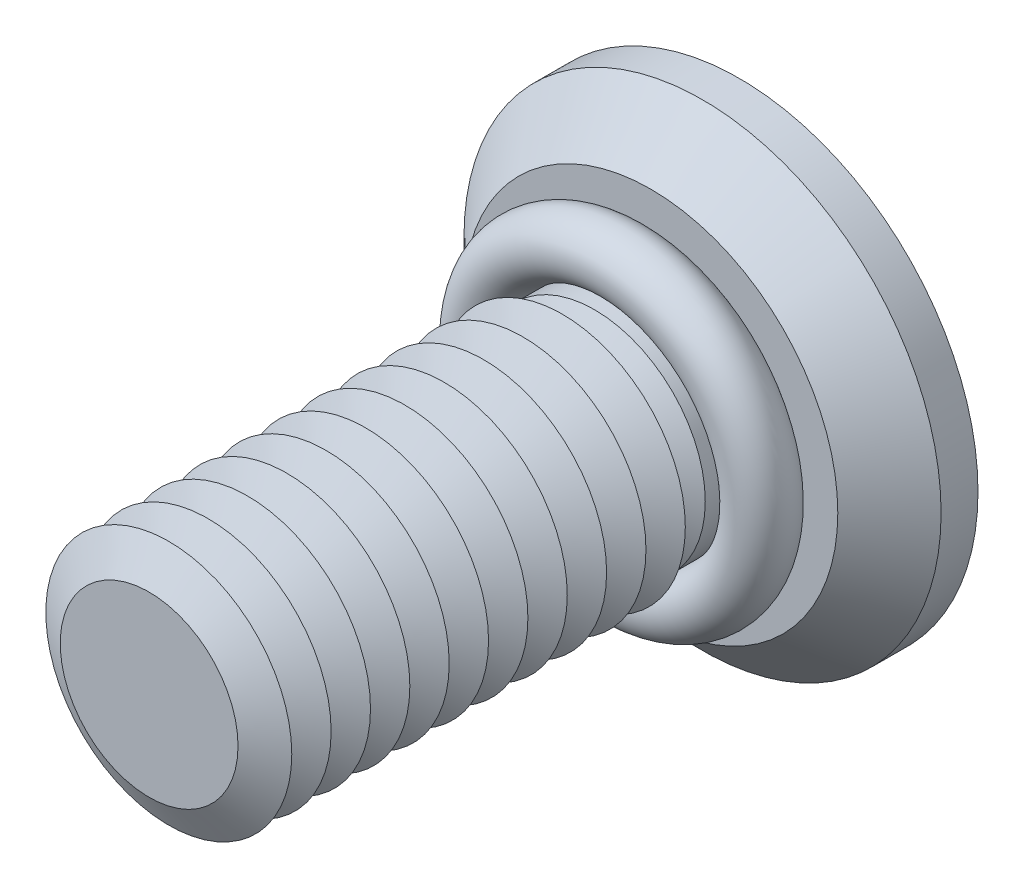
ISO-10303-21;
HEADER;
FILE_DESCRIPTION(('STEP AP214'),'2;1');
FILE_NAME('part.step','',(''),(''),'','','');
FILE_SCHEMA(('AUTOMOTIVE_DESIGN { 1 0 10303 214 1 1 1 1 }'));
ENDSEC;
DATA;
#1=APPLICATION_CONTEXT('core data for automotive mechanical design processes');
#2=APPLICATION_PROTOCOL_DEFINITION('international standard','automotive_design',2000,#1);
#3=PRODUCT_CONTEXT('',#1,'mechanical');
#4=PRODUCT('Part','Part','',(#3));
#5=PRODUCT_RELATED_PRODUCT_CATEGORY('part','',(#4));
#6=PRODUCT_DEFINITION_FORMATION('','',#4);
#7=PRODUCT_DEFINITION_CONTEXT('part definition',#1,'design');
#8=PRODUCT_DEFINITION('design','',#6,#7);
#9=PRODUCT_DEFINITION_SHAPE('','',#8);
#10=(LENGTH_UNIT() NAMED_UNIT(*) SI_UNIT(.MILLI.,.METRE.));
#11=(NAMED_UNIT(*) PLANE_ANGLE_UNIT() SI_UNIT($,.RADIAN.));
#12=(NAMED_UNIT(*) SI_UNIT($,.STERADIAN.) SOLID_ANGLE_UNIT());
#13=UNCERTAINTY_MEASURE_WITH_UNIT(LENGTH_MEASURE(1.E-05),#10,'distance_accuracy_value','');
#14=(GEOMETRIC_REPRESENTATION_CONTEXT(3) GLOBAL_UNCERTAINTY_ASSIGNED_CONTEXT((#13)) GLOBAL_UNIT_ASSIGNED_CONTEXT((#10,
#11,#12)) REPRESENTATION_CONTEXT('',''));
#15=CARTESIAN_POINT('',(0.,0.,0.));
#16=DIRECTION('',(0.,0.,1.));
#17=DIRECTION('',(1.,0.,0.));
#18=AXIS2_PLACEMENT_3D('',#15,#16,#17);
#19=CARTESIAN_POINT('',(0.,0.,2.4));
#20=DIRECTION('',(0.,0.,1.));
#21=DIRECTION('',(1.,0.,0.));
#22=AXIS2_PLACEMENT_3D('',#19,#20,#21);
#23=TOROIDAL_SURFACE('',#22,2.85,0.6);
#24=CARTESIAN_POINT('',(0.,2.85,2.4));
#25=DIRECTION('',(1.,0.,0.));
#26=DIRECTION('',(0.,0.,-1.));
#27=AXIS2_PLACEMENT_3D('',#24,#25,#26);
#28=CIRCLE('',#27,0.6);
#29=CARTESIAN_POINT('',(0.,3.45,2.4));
#30=VERTEX_POINT('',#29);
#31=EDGE_CURVE('P0_E10',#30,#30,#28,.T.);
#32=CARTESIAN_POINT('',(0.,0.,2.4));
#33=DIRECTION('',(0.,0.,1.));
#34=DIRECTION('',(1.,0.,0.));
#35=AXIS2_PLACEMENT_3D('',#32,#33,#34);
#36=CIRCLE('',#35,3.45);
#37=EDGE_CURVE('',#30,#30,#36,.T.);
#38=ORIENTED_EDGE('',*,*,#31,.F.);
#39=ORIENTED_EDGE('',*,*,#31,.T.);
#40=ORIENTED_EDGE('',*,*,#37,.T.);
#41=ORIENTED_EDGE('',*,*,#37,.F.);
#42=EDGE_LOOP('',(#38,#40,#39,#41));
#43=FACE_BOUND('',#42,.T.);
#44=ADVANCED_FACE('P0_F14',(#43),#23,.T.);
#45=CLOSED_SHELL('',(#44));
#46=MANIFOLD_SOLID_BREP('P0_B1',#45);
#47=CARTESIAN_POINT('',(0.,0.,8.));
#48=DIRECTION('',(0.,0.,-1.));
#49=DIRECTION('',(-1.,0.,0.));
#50=AXIS2_PLACEMENT_3D('',#47,#48,#49);
#51=CONICAL_SURFACE('',#50,1.80717967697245,1.0471975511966);
#52=CARTESIAN_POINT('',(0.,0.,7.6));
#53=DIRECTION('',(0.,0.,1.));
#54=DIRECTION('',(1.,0.,0.));
#55=AXIS2_PLACEMENT_3D('',#52,#53,#54);
#56=CIRCLE('',#55,2.5);
#57=CARTESIAN_POINT('',(2.5,0.,7.6));
#58=VERTEX_POINT('',#57);
#59=EDGE_CURVE('P1_E324',#58,#58,#56,.T.);
#60=ORIENTED_EDGE('',*,*,#59,.T.);
#61=EDGE_LOOP('',(#60));
#62=FACE_BOUND('',#61,.T.);
#63=CARTESIAN_POINT('',(0.,0.,8.));
#64=DIRECTION('',(0.,0.,1.));
#65=DIRECTION('',(1.,0.,0.));
#66=AXIS2_PLACEMENT_3D('',#63,#64,#65);
#67=CIRCLE('',#66,1.80717967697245);
#68=CARTESIAN_POINT('',(1.80717967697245,0.,8.));
#69=VERTEX_POINT('',#68);
#70=EDGE_CURVE('P1_E321',#69,#69,#67,.T.);
#71=ORIENTED_EDGE('',*,*,#70,.F.);
#72=EDGE_LOOP('',(#71));
#73=FACE_BOUND('',#72,.T.);
#74=ADVANCED_FACE('P1_F15',(#62,#73),#51,.T.);
#75=CARTESIAN_POINT('',(0.,0.,8.4));
#76=DIRECTION('',(0.,0.,1.));
#77=DIRECTION('',(1.,0.,0.));
#78=AXIS2_PLACEMENT_3D('',#75,#76,#77);
#79=CONICAL_SURFACE('',#78,2.5,1.0471975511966);
#80=ORIENTED_EDGE('',*,*,#70,.T.);
#81=EDGE_LOOP('',(#80));
#82=FACE_BOUND('',#81,.T.);
#83=CARTESIAN_POINT('',(0.,0.,8.4));
#84=DIRECTION('',(0.,0.,1.));
#85=DIRECTION('',(1.,0.,0.));
#86=AXIS2_PLACEMENT_3D('',#83,#84,#85);
#87=CIRCLE('',#86,2.5);
#88=CARTESIAN_POINT('',(2.5,0.,8.4));
#89=VERTEX_POINT('',#88);
#90=EDGE_CURVE('P1_E318',#89,#89,#87,.T.);
#91=ORIENTED_EDGE('',*,*,#90,.F.);
#92=EDGE_LOOP('',(#91));
#93=FACE_BOUND('',#92,.T.);
#94=ADVANCED_FACE('P1_F245',(#82,#93),#79,.T.);
#95=CARTESIAN_POINT('',(0.,0.,12.));
#96=DIRECTION('',(0.,0.,1.));
#97=DIRECTION('',(1.,0.,0.));
#98=AXIS2_PLACEMENT_3D('',#95,#96,#97);
#99=PLANE('',#98);
#100=CARTESIAN_POINT('',(0.,0.,12.));
#101=DIRECTION('',(0.,0.,1.));
#102=DIRECTION('',(1.,0.,0.));
#103=AXIS2_PLACEMENT_3D('',#100,#101,#102);
#104=CIRCLE('',#103,1.80717967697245);
#105=CARTESIAN_POINT('',(1.80717967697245,0.,12.));
#106=VERTEX_POINT('',#105);
#107=EDGE_CURVE('P1_E131',#106,#106,#104,.T.);
#108=ORIENTED_EDGE('',*,*,#107,.T.);
#109=EDGE_LOOP('',(#108));
#110=FACE_BOUND('',#109,.T.);
#111=ADVANCED_FACE('P1_F251',(#110),#99,.T.);
#112=CARTESIAN_POINT('',(0.,0.,12.));
#113=DIRECTION('',(0.,0.,-1.));
#114=DIRECTION('',(-1.,0.,0.));
#115=AXIS2_PLACEMENT_3D('',#112,#113,#114);
#116=CONICAL_SURFACE('',#115,1.80717967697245,1.0471975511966);
#117=CARTESIAN_POINT('',(0.,0.,11.6));
#118=DIRECTION('',(0.,0.,1.));
#119=DIRECTION('',(1.,0.,0.));
#120=AXIS2_PLACEMENT_3D('',#117,#118,#119);
#121=CIRCLE('',#120,2.5);
#122=CARTESIAN_POINT('',(2.5,0.,11.6));
#123=VERTEX_POINT('',#122);
#124=EDGE_CURVE('P1_E133',#123,#123,#121,.T.);
#125=ORIENTED_EDGE('',*,*,#124,.T.);
#126=EDGE_LOOP('',(#125));
#127=FACE_BOUND('',#126,.T.);
#128=ORIENTED_EDGE('',*,*,#107,.F.);
#129=EDGE_LOOP('',(#128));
#130=FACE_BOUND('',#129,.T.);
#131=ADVANCED_FACE('P1_F196',(#127,#130),#116,.T.);
#132=CARTESIAN_POINT('',(0.,0.,11.6));
#133=DIRECTION('',(0.,0.,1.));
#134=DIRECTION('',(1.,0.,0.));
#135=AXIS2_PLACEMENT_3D('',#132,#133,#134);
#136=CONICAL_SURFACE('',#135,2.5,1.0471975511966);
#137=CARTESIAN_POINT('',(0.,0.,11.2));
#138=DIRECTION('',(0.,0.,1.));
#139=DIRECTION('',(1.,0.,0.));
#140=AXIS2_PLACEMENT_3D('',#137,#138,#139);
#141=CIRCLE('',#140,1.80717967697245);
#142=CARTESIAN_POINT('',(1.80717967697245,0.,11.2));
#143=VERTEX_POINT('',#142);
#144=EDGE_CURVE('P1_E297',#143,#143,#141,.T.);
#145=ORIENTED_EDGE('',*,*,#144,.T.);
#146=EDGE_LOOP('',(#145));
#147=FACE_BOUND('',#146,.T.);
#148=ORIENTED_EDGE('',*,*,#124,.F.);
#149=EDGE_LOOP('',(#148));
#150=FACE_BOUND('',#149,.T.);
#151=ADVANCED_FACE('P1_F284',(#147,#150),#136,.T.);
#152=CARTESIAN_POINT('',(0.,0.,11.2));
#153=DIRECTION('',(0.,0.,-1.));
#154=DIRECTION('',(-1.,0.,0.));
#155=AXIS2_PLACEMENT_3D('',#152,#153,#154);
#156=CONICAL_SURFACE('',#155,1.80717967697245,1.0471975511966);
#157=CARTESIAN_POINT('',(0.,0.,10.8));
#158=DIRECTION('',(0.,0.,1.));
#159=DIRECTION('',(1.,0.,0.));
#160=AXIS2_PLACEMENT_3D('',#157,#158,#159);
#161=CIRCLE('',#160,2.5);
#162=CARTESIAN_POINT('',(2.5,0.,10.8));
#163=VERTEX_POINT('',#162);
#164=EDGE_CURVE('P1_E294',#163,#163,#161,.T.);
#165=ORIENTED_EDGE('',*,*,#164,.T.);
#166=EDGE_LOOP('',(#165));
#167=FACE_BOUND('',#166,.T.);
#168=ORIENTED_EDGE('',*,*,#144,.F.);
#169=EDGE_LOOP('',(#168));
#170=FACE_BOUND('',#169,.T.);
#171=ADVANCED_FACE('P1_F279',(#167,#170),#156,.T.);
#172=CARTESIAN_POINT('',(0.,0.,10.8));
#173=DIRECTION('',(0.,0.,1.));
#174=DIRECTION('',(1.,0.,0.));
#175=AXIS2_PLACEMENT_3D('',#172,#173,#174);
#176=CONICAL_SURFACE('',#175,2.5,1.0471975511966);
#177=CARTESIAN_POINT('',(0.,0.,10.4));
#178=DIRECTION('',(0.,0.,1.));
#179=DIRECTION('',(1.,0.,0.));
#180=AXIS2_PLACEMENT_3D('',#177,#178,#179);
#181=CIRCLE('',#180,1.80717967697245);
#182=CARTESIAN_POINT('',(1.80717967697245,0.,10.4));
#183=VERTEX_POINT('',#182);
#184=EDGE_CURVE('P1_E301',#183,#183,#181,.T.);
#185=ORIENTED_EDGE('',*,*,#184,.T.);
#186=EDGE_LOOP('',(#185));
#187=FACE_BOUND('',#186,.T.);
#188=ORIENTED_EDGE('',*,*,#164,.F.);
#189=EDGE_LOOP('',(#188));
#190=FACE_BOUND('',#189,.T.);
#191=ADVANCED_FACE('P1_F276',(#187,#190),#176,.T.);
#192=CARTESIAN_POINT('',(0.,0.,10.4));
#193=DIRECTION('',(0.,0.,-1.));
#194=DIRECTION('',(-1.,0.,0.));
#195=AXIS2_PLACEMENT_3D('',#192,#193,#194);
#196=CONICAL_SURFACE('',#195,1.80717967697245,1.0471975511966);
#197=CARTESIAN_POINT('',(0.,0.,10.));
#198=DIRECTION('',(0.,0.,1.));
#199=DIRECTION('',(1.,0.,0.));
#200=AXIS2_PLACEMENT_3D('',#197,#198,#199);
#201=CIRCLE('',#200,2.5);
#202=CARTESIAN_POINT('',(2.5,0.,10.));
#203=VERTEX_POINT('',#202);
#204=EDGE_CURVE('P1_E306',#203,#203,#201,.T.);
#205=ORIENTED_EDGE('',*,*,#204,.T.);
#206=EDGE_LOOP('',(#205));
#207=FACE_BOUND('',#206,.T.);
#208=ORIENTED_EDGE('',*,*,#184,.F.);
#209=EDGE_LOOP('',(#208));
#210=FACE_BOUND('',#209,.T.);
#211=ADVANCED_FACE('P1_F271',(#207,#210),#196,.T.);
#212=CARTESIAN_POINT('',(0.,0.,10.));
#213=DIRECTION('',(0.,0.,1.));
#214=DIRECTION('',(1.,0.,0.));
#215=AXIS2_PLACEMENT_3D('',#212,#213,#214);
#216=CONICAL_SURFACE('',#215,2.5,1.0471975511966);
#217=CARTESIAN_POINT('',(0.,0.,9.6));
#218=DIRECTION('',(0.,0.,1.));
#219=DIRECTION('',(1.,0.,0.));
#220=AXIS2_PLACEMENT_3D('',#217,#218,#219);
#221=CIRCLE('',#220,1.80717967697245);
#222=CARTESIAN_POINT('',(1.80717967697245,0.,9.6));
#223=VERTEX_POINT('',#222);
#224=EDGE_CURVE('P1_E309',#223,#223,#221,.T.);
#225=ORIENTED_EDGE('',*,*,#224,.T.);
#226=EDGE_LOOP('',(#225));
#227=FACE_BOUND('',#226,.T.);
#228=ORIENTED_EDGE('',*,*,#204,.F.);
#229=EDGE_LOOP('',(#228));
#230=FACE_BOUND('',#229,.T.);
#231=ADVANCED_FACE('P1_F268',(#227,#230),#216,.T.);
#232=CARTESIAN_POINT('',(0.,0.,9.6));
#233=DIRECTION('',(0.,0.,-1.));
#234=DIRECTION('',(-1.,0.,0.));
#235=AXIS2_PLACEMENT_3D('',#232,#233,#234);
#236=CONICAL_SURFACE('',#235,1.80717967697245,1.0471975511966);
#237=CARTESIAN_POINT('',(0.,0.,9.2));
#238=DIRECTION('',(0.,0.,1.));
#239=DIRECTION('',(1.,0.,0.));
#240=AXIS2_PLACEMENT_3D('',#237,#238,#239);
#241=CIRCLE('',#240,2.5);
#242=CARTESIAN_POINT('',(2.5,0.,9.2));
#243=VERTEX_POINT('',#242);
#244=EDGE_CURVE('P1_E312',#243,#243,#241,.T.);
#245=ORIENTED_EDGE('',*,*,#244,.T.);
#246=EDGE_LOOP('',(#245));
#247=FACE_BOUND('',#246,.T.);
#248=ORIENTED_EDGE('',*,*,#224,.F.);
#249=EDGE_LOOP('',(#248));
#250=FACE_BOUND('',#249,.T.);
#251=ADVANCED_FACE('P1_F262',(#247,#250),#236,.T.);
#252=CARTESIAN_POINT('',(0.,0.,9.2));
#253=DIRECTION('',(0.,0.,1.));
#254=DIRECTION('',(1.,0.,0.));
#255=AXIS2_PLACEMENT_3D('',#252,#253,#254);
#256=CONICAL_SURFACE('',#255,2.5,1.0471975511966);
#257=CARTESIAN_POINT('',(0.,0.,8.8));
#258=DIRECTION('',(0.,0.,1.));
#259=DIRECTION('',(1.,0.,0.));
#260=AXIS2_PLACEMENT_3D('',#257,#258,#259);
#261=CIRCLE('',#260,1.80717967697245);
#262=CARTESIAN_POINT('',(1.80717967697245,0.,8.8));
#263=VERTEX_POINT('',#262);
#264=EDGE_CURVE('P1_E315',#263,#263,#261,.T.);
#265=ORIENTED_EDGE('',*,*,#264,.T.);
#266=EDGE_LOOP('',(#265));
#267=FACE_BOUND('',#266,.T.);
#268=ORIENTED_EDGE('',*,*,#244,.F.);
#269=EDGE_LOOP('',(#268));
#270=FACE_BOUND('',#269,.T.);
#271=ADVANCED_FACE('P1_F258',(#267,#270),#256,.T.);
#272=CARTESIAN_POINT('',(0.,0.,8.8));
#273=DIRECTION('',(0.,0.,-1.));
#274=DIRECTION('',(-1.,0.,0.));
#275=AXIS2_PLACEMENT_3D('',#272,#273,#274);
#276=CONICAL_SURFACE('',#275,1.80717967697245,1.0471975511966);
#277=ORIENTED_EDGE('',*,*,#90,.T.);
#278=EDGE_LOOP('',(#277));
#279=FACE_BOUND('',#278,.T.);
#280=ORIENTED_EDGE('',*,*,#264,.F.);
#281=EDGE_LOOP('',(#280));
#282=FACE_BOUND('',#281,.T.);
#283=ADVANCED_FACE('P1_F261',(#279,#282),#276,.T.);
#284=CARTESIAN_POINT('',(0.,0.,7.2));
#285=DIRECTION('',(0.,0.,-1.));
#286=DIRECTION('',(-1.,0.,0.));
#287=AXIS2_PLACEMENT_3D('',#284,#285,#286);
#288=CONICAL_SURFACE('',#287,1.80717967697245,1.0471975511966);
#289=CARTESIAN_POINT('',(0.,0.,6.8));
#290=DIRECTION('',(0.,0.,1.));
#291=DIRECTION('',(1.,0.,0.));
#292=AXIS2_PLACEMENT_3D('',#289,#290,#291);
#293=CIRCLE('',#292,2.5);
#294=CARTESIAN_POINT('',(2.5,0.,6.8));
#295=VERTEX_POINT('',#294);
#296=EDGE_CURVE('P1_E329',#295,#295,#293,.T.);
#297=ORIENTED_EDGE('',*,*,#296,.T.);
#298=EDGE_LOOP('',(#297));
#299=FACE_BOUND('',#298,.T.);
#300=CARTESIAN_POINT('',(0.,0.,7.2));
#301=DIRECTION('',(0.,0.,1.));
#302=DIRECTION('',(1.,0.,0.));
#303=AXIS2_PLACEMENT_3D('',#300,#301,#302);
#304=CIRCLE('',#303,1.80717967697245);
#305=CARTESIAN_POINT('',(1.80717967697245,0.,7.2));
#306=VERTEX_POINT('',#305);
#307=EDGE_CURVE('P1_E326',#306,#306,#304,.T.);
#308=ORIENTED_EDGE('',*,*,#307,.F.);
#309=EDGE_LOOP('',(#308));
#310=FACE_BOUND('',#309,.T.);
#311=ADVANCED_FACE('P1_F266',(#299,#310),#288,.T.);
#312=CARTESIAN_POINT('',(0.,0.,7.6));
#313=DIRECTION('',(0.,0.,1.));
#314=DIRECTION('',(1.,0.,0.));
#315=AXIS2_PLACEMENT_3D('',#312,#313,#314);
#316=CONICAL_SURFACE('',#315,2.5,1.0471975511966);
#317=ORIENTED_EDGE('',*,*,#307,.T.);
#318=EDGE_LOOP('',(#317));
#319=FACE_BOUND('',#318,.T.);
#320=ORIENTED_EDGE('',*,*,#59,.F.);
#321=EDGE_LOOP('',(#320));
#322=FACE_BOUND('',#321,.T.);
#323=ADVANCED_FACE('P1_F461',(#319,#322),#316,.T.);
#324=CARTESIAN_POINT('',(0.,0.,6.4));
#325=DIRECTION('',(0.,0.,-1.));
#326=DIRECTION('',(-1.,0.,0.));
#327=AXIS2_PLACEMENT_3D('',#324,#325,#326);
#328=CONICAL_SURFACE('',#327,1.80717967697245,1.0471975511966);
#329=CARTESIAN_POINT('',(0.,0.,6.));
#330=DIRECTION('',(0.,0.,1.));
#331=DIRECTION('',(1.,0.,0.));
#332=AXIS2_PLACEMENT_3D('',#329,#330,#331);
#333=CIRCLE('',#332,2.5);
#334=CARTESIAN_POINT('',(2.5,0.,6.));
#335=VERTEX_POINT('',#334);
#336=EDGE_CURVE('P1_E335',#335,#335,#333,.T.);
#337=ORIENTED_EDGE('',*,*,#336,.T.);
#338=EDGE_LOOP('',(#337));
#339=FACE_BOUND('',#338,.T.);
#340=CARTESIAN_POINT('',(0.,0.,6.4));
#341=DIRECTION('',(0.,0.,1.));
#342=DIRECTION('',(1.,0.,0.));
#343=AXIS2_PLACEMENT_3D('',#340,#341,#342);
#344=CIRCLE('',#343,1.80717967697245);
#345=CARTESIAN_POINT('',(1.80717967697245,0.,6.4));
#346=VERTEX_POINT('',#345);
#347=EDGE_CURVE('P1_E332',#346,#346,#344,.T.);
#348=ORIENTED_EDGE('',*,*,#347,.F.);
#349=EDGE_LOOP('',(#348));
#350=FACE_BOUND('',#349,.T.);
#351=ADVANCED_FACE('P1_F470',(#339,#350),#328,.T.);
#352=CARTESIAN_POINT('',(0.,0.,6.8));
#353=DIRECTION('',(0.,0.,1.));
#354=DIRECTION('',(1.,0.,0.));
#355=AXIS2_PLACEMENT_3D('',#352,#353,#354);
#356=CONICAL_SURFACE('',#355,2.5,1.0471975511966);
#357=ORIENTED_EDGE('',*,*,#347,.T.);
#358=EDGE_LOOP('',(#357));
#359=FACE_BOUND('',#358,.T.);
#360=ORIENTED_EDGE('',*,*,#296,.F.);
#361=EDGE_LOOP('',(#360));
#362=FACE_BOUND('',#361,.T.);
#363=ADVANCED_FACE('P1_F480',(#359,#362),#356,.T.);
#364=CARTESIAN_POINT('',(0.,0.,5.6));
#365=DIRECTION('',(0.,0.,-1.));
#366=DIRECTION('',(-1.,0.,0.));
#367=AXIS2_PLACEMENT_3D('',#364,#365,#366);
#368=CONICAL_SURFACE('',#367,1.80717967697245,1.0471975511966);
#369=CARTESIAN_POINT('',(0.,0.,5.2));
#370=DIRECTION('',(0.,0.,1.));
#371=DIRECTION('',(1.,0.,0.));
#372=AXIS2_PLACEMENT_3D('',#369,#370,#371);
#373=CIRCLE('',#372,2.5);
#374=CARTESIAN_POINT('',(2.5,0.,5.2));
#375=VERTEX_POINT('',#374);
#376=EDGE_CURVE('P1_E341',#375,#375,#373,.T.);
#377=ORIENTED_EDGE('',*,*,#376,.T.);
#378=EDGE_LOOP('',(#377));
#379=FACE_BOUND('',#378,.T.);
#380=CARTESIAN_POINT('',(0.,0.,5.6));
#381=DIRECTION('',(0.,0.,1.));
#382=DIRECTION('',(1.,0.,0.));
#383=AXIS2_PLACEMENT_3D('',#380,#381,#382);
#384=CIRCLE('',#383,1.80717967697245);
#385=CARTESIAN_POINT('',(1.80717967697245,0.,5.6));
#386=VERTEX_POINT('',#385);
#387=EDGE_CURVE('P1_E338',#386,#386,#384,.T.);
#388=ORIENTED_EDGE('',*,*,#387,.F.);
#389=EDGE_LOOP('',(#388));
#390=FACE_BOUND('',#389,.T.);
#391=ADVANCED_FACE('P1_F490',(#379,#390),#368,.T.);
#392=CARTESIAN_POINT('',(0.,0.,6.));
#393=DIRECTION('',(0.,0.,1.));
#394=DIRECTION('',(1.,0.,0.));
#395=AXIS2_PLACEMENT_3D('',#392,#393,#394);
#396=CONICAL_SURFACE('',#395,2.5,1.0471975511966);
#397=ORIENTED_EDGE('',*,*,#387,.T.);
#398=EDGE_LOOP('',(#397));
#399=FACE_BOUND('',#398,.T.);
#400=ORIENTED_EDGE('',*,*,#336,.F.);
#401=EDGE_LOOP('',(#400));
#402=FACE_BOUND('',#401,.T.);
#403=ADVANCED_FACE('P1_F500',(#399,#402),#396,.T.);
#404=CARTESIAN_POINT('',(0.,0.,4.8));
#405=DIRECTION('',(0.,0.,-1.));
#406=DIRECTION('',(-1.,0.,0.));
#407=AXIS2_PLACEMENT_3D('',#404,#405,#406);
#408=CONICAL_SURFACE('',#407,1.80717967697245,1.0471975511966);
#409=CARTESIAN_POINT('',(0.,0.,4.4));
#410=DIRECTION('',(0.,0.,1.));
#411=DIRECTION('',(1.,0.,0.));
#412=AXIS2_PLACEMENT_3D('',#409,#410,#411);
#413=CIRCLE('',#412,2.5);
#414=CARTESIAN_POINT('',(2.5,0.,4.4));
#415=VERTEX_POINT('',#414);
#416=EDGE_CURVE('P1_E347',#415,#415,#413,.T.);
#417=ORIENTED_EDGE('',*,*,#416,.T.);
#418=EDGE_LOOP('',(#417));
#419=FACE_BOUND('',#418,.T.);
#420=CARTESIAN_POINT('',(0.,0.,4.8));
#421=DIRECTION('',(0.,0.,1.));
#422=DIRECTION('',(1.,0.,0.));
#423=AXIS2_PLACEMENT_3D('',#420,#421,#422);
#424=CIRCLE('',#423,1.80717967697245);
#425=CARTESIAN_POINT('',(1.80717967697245,0.,4.8));
#426=VERTEX_POINT('',#425);
#427=EDGE_CURVE('P1_E344',#426,#426,#424,.T.);
#428=ORIENTED_EDGE('',*,*,#427,.F.);
#429=EDGE_LOOP('',(#428));
#430=FACE_BOUND('',#429,.T.);
#431=ADVANCED_FACE('P1_F510',(#419,#430),#408,.T.);
#432=CARTESIAN_POINT('',(0.,0.,5.2));
#433=DIRECTION('',(0.,0.,1.));
#434=DIRECTION('',(1.,0.,0.));
#435=AXIS2_PLACEMENT_3D('',#432,#433,#434);
#436=CONICAL_SURFACE('',#435,2.5,1.0471975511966);
#437=ORIENTED_EDGE('',*,*,#427,.T.);
#438=EDGE_LOOP('',(#437));
#439=FACE_BOUND('',#438,.T.);
#440=ORIENTED_EDGE('',*,*,#376,.F.);
#441=EDGE_LOOP('',(#440));
#442=FACE_BOUND('',#441,.T.);
#443=ADVANCED_FACE('P1_F520',(#439,#442),#436,.T.);
#444=CARTESIAN_POINT('',(0.,0.,4.));
#445=DIRECTION('',(0.,0.,-1.));
#446=DIRECTION('',(-1.,0.,0.));
#447=AXIS2_PLACEMENT_3D('',#444,#445,#446);
#448=CONICAL_SURFACE('',#447,1.80717967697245,1.0471975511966);
#449=CARTESIAN_POINT('',(0.,0.,3.6));
#450=DIRECTION('',(0.,0.,1.));
#451=DIRECTION('',(1.,0.,0.));
#452=AXIS2_PLACEMENT_3D('',#449,#450,#451);
#453=CIRCLE('',#452,2.5);
#454=CARTESIAN_POINT('',(2.5,0.,3.6));
#455=VERTEX_POINT('',#454);
#456=EDGE_CURVE('P1_E353',#455,#455,#453,.T.);
#457=ORIENTED_EDGE('',*,*,#456,.T.);
#458=EDGE_LOOP('',(#457));
#459=FACE_BOUND('',#458,.T.);
#460=CARTESIAN_POINT('',(0.,0.,4.));
#461=DIRECTION('',(0.,0.,1.));
#462=DIRECTION('',(1.,0.,0.));
#463=AXIS2_PLACEMENT_3D('',#460,#461,#462);
#464=CIRCLE('',#463,1.80717967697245);
#465=CARTESIAN_POINT('',(1.80717967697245,0.,4.));
#466=VERTEX_POINT('',#465);
#467=EDGE_CURVE('P1_E350',#466,#466,#464,.T.);
#468=ORIENTED_EDGE('',*,*,#467,.F.);
#469=EDGE_LOOP('',(#468));
#470=FACE_BOUND('',#469,.T.);
#471=ADVANCED_FACE('P1_F530',(#459,#470),#448,.T.);
#472=CARTESIAN_POINT('',(0.,0.,4.4));
#473=DIRECTION('',(0.,0.,1.));
#474=DIRECTION('',(1.,0.,0.));
#475=AXIS2_PLACEMENT_3D('',#472,#473,#474);
#476=CONICAL_SURFACE('',#475,2.5,1.0471975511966);
#477=ORIENTED_EDGE('',*,*,#467,.T.);
#478=EDGE_LOOP('',(#477));
#479=FACE_BOUND('',#478,.T.);
#480=ORIENTED_EDGE('',*,*,#416,.F.);
#481=EDGE_LOOP('',(#480));
#482=FACE_BOUND('',#481,.T.);
#483=ADVANCED_FACE('P1_F366',(#479,#482),#476,.T.);
#484=CARTESIAN_POINT('',(0.,0.,3.2));
#485=DIRECTION('',(0.,0.,-1.));
#486=DIRECTION('',(-1.,0.,0.));
#487=AXIS2_PLACEMENT_3D('',#484,#485,#486);
#488=CONICAL_SURFACE('',#487,1.80717967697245,1.0471975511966);
#489=CARTESIAN_POINT('',(0.,0.,3.2));
#490=DIRECTION('',(0.,0.,1.));
#491=DIRECTION('',(1.,0.,0.));
#492=AXIS2_PLACEMENT_3D('',#489,#490,#491);
#493=CIRCLE('',#492,1.80717967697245);
#494=CARTESIAN_POINT('',(1.80717967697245,0.,3.2));
#495=VERTEX_POINT('',#494);
#496=EDGE_CURVE('P1_E356',#495,#495,#493,.T.);
#497=ORIENTED_EDGE('',*,*,#496,.F.);
#498=EDGE_LOOP('',(#497));
#499=FACE_BOUND('',#498,.T.);
#500=CARTESIAN_POINT('',(0.,0.,2.9443375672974));
#501=DIRECTION('',(0.,0.,-1.));
#502=DIRECTION('',(-1.,0.,0.));
#503=AXIS2_PLACEMENT_3D('',#500,#501,#502);
#504=CIRCLE('',#503,2.25);
#505=CARTESIAN_POINT('',(-2.25,0.,2.9443375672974));
#506=VERTEX_POINT('',#505);
#507=EDGE_CURVE('P1_E19',#506,#506,#504,.F.);
#508=ORIENTED_EDGE('',*,*,#507,.T.);
#509=EDGE_LOOP('',(#508));
#510=FACE_BOUND('',#509,.T.);
#511=ADVANCED_FACE('P1_F363',(#499,#510),#488,.T.);
#512=CARTESIAN_POINT('',(0.,0.,3.6));
#513=DIRECTION('',(0.,0.,1.));
#514=DIRECTION('',(1.,0.,0.));
#515=AXIS2_PLACEMENT_3D('',#512,#513,#514);
#516=CONICAL_SURFACE('',#515,2.5,1.0471975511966);
#517=ORIENTED_EDGE('',*,*,#496,.T.);
#518=EDGE_LOOP('',(#517));
#519=FACE_BOUND('',#518,.T.);
#520=ORIENTED_EDGE('',*,*,#456,.F.);
#521=EDGE_LOOP('',(#520));
#522=FACE_BOUND('',#521,.T.);
#523=ADVANCED_FACE('P1_F360',(#519,#522),#516,.T.);
#524=CARTESIAN_POINT('',(0.,0.,2.));
#525=DIRECTION('',(0.,0.,-1.));
#526=DIRECTION('',(-1.,0.,0.));
#527=AXIS2_PLACEMENT_3D('',#524,#525,#526);
#528=CONICAL_SURFACE('',#527,1.5,1.0471975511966);
#529=CARTESIAN_POINT('',(0.,0.,2.86602540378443));
#530=VERTEX_POINT('',#529);
#531=VERTEX_LOOP('',#530);
#532=FACE_BOUND('',#531,.T.);
#533=CARTESIAN_POINT('',(0.,0.,2.));
#534=DIRECTION('',(0.,0.,-1.));
#535=DIRECTION('',(-1.,0.,0.));
#536=AXIS2_PLACEMENT_3D('',#533,#534,#535);
#537=CIRCLE('',#536,1.5);
#538=CARTESIAN_POINT('',(-1.5,0.,2.));
#539=VERTEX_POINT('',#538);
#540=CARTESIAN_POINT('',(-0.75,1.29903810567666,2.));
#541=VERTEX_POINT('',#540);
#542=EDGE_CURVE('P1_E117',#539,#541,#537,.T.);
#543=ORIENTED_EDGE('',*,*,#542,.T.);
#544=CARTESIAN_POINT('',(0.,0.,2.));
#545=DIRECTION('',(0.,0.,-1.));
#546=DIRECTION('',(-1.,0.,0.));
#547=AXIS2_PLACEMENT_3D('',#544,#545,#546);
#548=CIRCLE('',#547,1.5);
#549=CARTESIAN_POINT('',(0.75,1.29903810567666,2.));
#550=VERTEX_POINT('',#549);
#551=EDGE_CURVE('P1_E24',#541,#550,#548,.T.);
#552=ORIENTED_EDGE('',*,*,#551,.T.);
#553=CARTESIAN_POINT('',(1.5,0.,2.));
#554=VERTEX_POINT('',#553);
#555=EDGE_CURVE('P1_E765',#550,#554,#548,.T.);
#556=ORIENTED_EDGE('',*,*,#555,.T.);
#557=CARTESIAN_POINT('',(0.750000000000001,-1.29903810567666,2.));
#558=VERTEX_POINT('',#557);
#559=EDGE_CURVE('P1_E758',#554,#558,#548,.T.);
#560=ORIENTED_EDGE('',*,*,#559,.T.);
#561=CARTESIAN_POINT('',(-0.75,-1.29903810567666,2.));
#562=VERTEX_POINT('',#561);
#563=EDGE_CURVE('P1_E182',#558,#562,#548,.T.);
#564=ORIENTED_EDGE('',*,*,#563,.T.);
#565=EDGE_CURVE('P1_E179',#562,#539,#548,.T.);
#566=ORIENTED_EDGE('',*,*,#565,.T.);
#567=EDGE_LOOP('',(#543,#552,#556,#560,#564,#566));
#568=FACE_BOUND('',#567,.T.);
#569=ADVANCED_FACE('P1_F198',(#532,#568),#528,.F.);
#570=CARTESIAN_POINT('',(0.,0.,2.));
#571=DIRECTION('',(0.,0.,-1.));
#572=DIRECTION('',(-1.,0.,0.));
#573=AXIS2_PLACEMENT_3D('',#570,#571,#572);
#574=PLANE('',#573);
#575=ORIENTED_EDGE('',*,*,#563,.F.);
#576=DIRECTION('',(-0.866025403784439,-0.5,0.));
#577=VECTOR('',#576,1.);
#578=CARTESIAN_POINT('',(1.5,-0.866025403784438,2.));
#579=LINE('',#578,#577);
#580=CARTESIAN_POINT('',(0.,-1.73205080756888,2.));
#581=VERTEX_POINT('',#580);
#582=EDGE_CURVE('P1_E774',#558,#581,#579,.T.);
#583=ORIENTED_EDGE('',*,*,#582,.T.);
#584=DIRECTION('',(-0.866025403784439,0.5,0.));
#585=VECTOR('',#584,1.);
#586=CARTESIAN_POINT('',(0.,-1.73205080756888,2.));
#587=LINE('',#586,#585);
#588=EDGE_CURVE('P1_E781',#581,#562,#587,.T.);
#589=ORIENTED_EDGE('',*,*,#588,.T.);
#590=EDGE_LOOP('',(#575,#583,#589));
#591=FACE_BOUND('',#590,.T.);
#592=ADVANCED_FACE('P1_F572',(#591),#574,.T.);
#593=ORIENTED_EDGE('',*,*,#565,.F.);
#594=CARTESIAN_POINT('',(-1.5,-0.86602540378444,2.));
#595=VERTEX_POINT('',#594);
#596=EDGE_CURVE('P1_E784',#562,#595,#587,.T.);
#597=ORIENTED_EDGE('',*,*,#596,.T.);
#598=DIRECTION('',(0.,1.,0.));
#599=VECTOR('',#598,1.);
#600=CARTESIAN_POINT('',(-1.5,-0.86602540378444,2.));
#601=LINE('',#600,#599);
#602=EDGE_CURVE('P1_E123',#595,#539,#601,.T.);
#603=ORIENTED_EDGE('',*,*,#602,.T.);
#604=EDGE_LOOP('',(#593,#597,#603));
#605=FACE_BOUND('',#604,.T.);
#606=ADVANCED_FACE('P1_F231',(#605),#574,.T.);
#607=ORIENTED_EDGE('',*,*,#542,.F.);
#608=CARTESIAN_POINT('',(-1.5,0.866025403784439,2.));
#609=VERTEX_POINT('',#608);
#610=EDGE_CURVE('P1_E786',#539,#609,#601,.T.);
#611=ORIENTED_EDGE('',*,*,#610,.T.);
#612=DIRECTION('',(0.866025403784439,0.5,0.));
#613=VECTOR('',#612,1.);
#614=CARTESIAN_POINT('',(-1.5,0.866025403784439,2.));
#615=LINE('',#614,#613);
#616=EDGE_CURVE('P1_E789',#609,#541,#615,.T.);
#617=ORIENTED_EDGE('',*,*,#616,.T.);
#618=EDGE_LOOP('',(#607,#611,#617));
#619=FACE_BOUND('',#618,.T.);
#620=ADVANCED_FACE('P1_F589',(#619),#574,.T.);
#621=ORIENTED_EDGE('',*,*,#551,.F.);
#622=CARTESIAN_POINT('',(0.,1.73205080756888,2.));
#623=VERTEX_POINT('',#622);
#624=EDGE_CURVE('P1_E788',#541,#623,#615,.T.);
#625=ORIENTED_EDGE('',*,*,#624,.T.);
#626=DIRECTION('',(0.866025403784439,-0.5,0.));
#627=VECTOR('',#626,1.);
#628=CARTESIAN_POINT('',(0.,1.73205080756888,2.));
#629=LINE('',#628,#627);
#630=EDGE_CURVE('P1_E161',#623,#550,#629,.T.);
#631=ORIENTED_EDGE('',*,*,#630,.T.);
#632=EDGE_LOOP('',(#621,#625,#631));
#633=FACE_BOUND('',#632,.T.);
#634=ADVANCED_FACE('P1_F598',(#633),#574,.T.);
#635=ORIENTED_EDGE('',*,*,#555,.F.);
#636=CARTESIAN_POINT('',(1.5,0.866025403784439,2.));
#637=VERTEX_POINT('',#636);
#638=EDGE_CURVE('P1_E773',#550,#637,#629,.T.);
#639=ORIENTED_EDGE('',*,*,#638,.T.);
#640=DIRECTION('',(0.,-1.,0.));
#641=VECTOR('',#640,1.);
#642=CARTESIAN_POINT('',(1.5,0.866025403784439,2.));
#643=LINE('',#642,#641);
#644=EDGE_CURVE('P1_E768',#637,#554,#643,.T.);
#645=ORIENTED_EDGE('',*,*,#644,.T.);
#646=EDGE_LOOP('',(#635,#639,#645));
#647=FACE_BOUND('',#646,.T.);
#648=ADVANCED_FACE('P1_F607',(#647),#574,.T.);
#649=ORIENTED_EDGE('',*,*,#559,.F.);
#650=CARTESIAN_POINT('',(1.5,-0.866025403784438,2.));
#651=VERTEX_POINT('',#650);
#652=EDGE_CURVE('P1_E760',#554,#651,#643,.T.);
#653=ORIENTED_EDGE('',*,*,#652,.T.);
#654=EDGE_CURVE('P1_E125',#651,#558,#579,.T.);
#655=ORIENTED_EDGE('',*,*,#654,.T.);
#656=EDGE_LOOP('',(#649,#653,#655));
#657=FACE_BOUND('',#656,.T.);
#658=ADVANCED_FACE('P1_F229',(#657),#574,.T.);
#659=CARTESIAN_POINT('',(1.5,-0.866025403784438,2.));
#660=DIRECTION('',(0.5,-0.866025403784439,0.));
#661=DIRECTION('',(0.866025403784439,0.5,0.));
#662=AXIS2_PLACEMENT_3D('',#659,#660,#661);
#663=PLANE('',#662);
#664=DIRECTION('',(0.,0.,-1.));
#665=VECTOR('',#664,1.);
#666=CARTESIAN_POINT('',(1.5,-0.866025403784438,2.));
#667=LINE('',#666,#665);
#668=CARTESIAN_POINT('',(1.5,-0.866025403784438,0.));
#669=VERTEX_POINT('',#668);
#670=EDGE_CURVE('P1_E164',#651,#669,#667,.T.);
#671=ORIENTED_EDGE('',*,*,#670,.T.);
#672=CARTESIAN_POINT('',(1.5002,-0.865909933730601,-3.09432014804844E-05));
#673=CARTESIAN_POINT('',(1.43789222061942,-0.901883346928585,0.00961367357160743));
#674=CARTESIAN_POINT('',(1.37547144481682,-0.937921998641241,0.0183695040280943));
#675=CARTESIAN_POINT('',(1.25040937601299,-1.01012661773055,0.0337528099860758));
#676=CARTESIAN_POINT('',(1.18776800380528,-1.04629263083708,0.0403794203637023));
#677=CARTESIAN_POINT('',(1.06264466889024,-1.11853262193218,0.0511173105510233));
#678=CARTESIAN_POINT('',(1.00016355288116,-1.15460611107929,0.0552413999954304));
#679=CARTESIAN_POINT('',(0.875121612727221,-1.22679910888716,0.0607713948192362));
#680=CARTESIAN_POINT('',(0.812560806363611,-1.26291860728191,0.0621778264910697));
#681=CARTESIAN_POINT('',(0.68743919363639,-1.33515760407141,0.0621778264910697));
#682=CARTESIAN_POINT('',(0.62487838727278,-1.37127710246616,0.0607713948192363));
#683=CARTESIAN_POINT('',(0.49983644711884,-1.44347010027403,0.0552413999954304));
#684=CARTESIAN_POINT('',(0.437355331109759,-1.47954358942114,0.0511173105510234));
#685=CARTESIAN_POINT('',(0.312231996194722,-1.55178358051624,0.0403794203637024));
#686=CARTESIAN_POINT('',(0.249590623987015,-1.58794959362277,0.0337528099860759));
#687=CARTESIAN_POINT('',(0.124528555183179,-1.66015421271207,0.0183695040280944));
#688=CARTESIAN_POINT('',(0.0621077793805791,-1.69619286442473,0.00961367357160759));
#689=CARTESIAN_POINT('',(-0.000199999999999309,-1.73216627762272,-3.09432014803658E-05));
#690=B_SPLINE_CURVE_WITH_KNOTS('',3,(#672,#673,#674,#675,#676,#677,#678,#679,#680,#681,#682,
#683,#684,#685,#686,#687,#688,#689),.UNSPECIFIED.,.F.,.F.,(4,2,2,2,2,2,2,2,4),(0.,
0.217782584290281,0.435653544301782,0.652399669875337,0.869103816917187,1.08580796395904,
1.30255408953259,1.52042504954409,1.73820763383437),.UNSPECIFIED.);
#691=CARTESIAN_POINT('',(0.,-1.73205080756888,0.));
#692=VERTEX_POINT('',#691);
#693=EDGE_CURVE('P1_E118',#669,#692,#690,.T.);
#694=ORIENTED_EDGE('',*,*,#693,.T.);
#695=DIRECTION('',(0.,0.,-1.));
#696=VECTOR('',#695,1.);
#697=CARTESIAN_POINT('',(0.,-1.73205080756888,2.));
#698=LINE('',#697,#696);
#699=EDGE_CURVE('P1_E116',#581,#692,#698,.T.);
#700=ORIENTED_EDGE('',*,*,#699,.F.);
#701=ORIENTED_EDGE('',*,*,#582,.F.);
#702=ORIENTED_EDGE('',*,*,#654,.F.);
#703=EDGE_LOOP('',(#671,#694,#700,#701,#702));
#704=FACE_BOUND('',#703,.T.);
#705=ADVANCED_FACE('P1_F226',(#704),#663,.F.);
#706=CARTESIAN_POINT('',(0.,-1.73205080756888,2.));
#707=DIRECTION('',(-0.5,-0.866025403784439,0.));
#708=DIRECTION('',(0.866025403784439,-0.5,0.));
#709=AXIS2_PLACEMENT_3D('',#706,#707,#708);
#710=PLANE('',#709);
#711=ORIENTED_EDGE('',*,*,#699,.T.);
#712=CARTESIAN_POINT('',(0.000200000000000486,-1.73216627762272,-3.09432014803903E-05));
#713=CARTESIAN_POINT('',(-0.0621077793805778,-1.69619286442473,0.00961367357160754));
#714=CARTESIAN_POINT('',(-0.124528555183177,-1.66015421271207,0.0183695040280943));
#715=CARTESIAN_POINT('',(-0.249590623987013,-1.58794959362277,0.0337528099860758));
#716=CARTESIAN_POINT('',(-0.312231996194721,-1.55178358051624,0.0403794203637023));
#717=CARTESIAN_POINT('',(-0.437355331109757,-1.47954358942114,0.0511173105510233));
#718=CARTESIAN_POINT('',(-0.499836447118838,-1.44347010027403,0.0552413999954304));
#719=CARTESIAN_POINT('',(-0.624878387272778,-1.37127710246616,0.0607713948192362));
#720=CARTESIAN_POINT('',(-0.687439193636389,-1.33515760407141,0.0621778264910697));
#721=CARTESIAN_POINT('',(-0.81256080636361,-1.26291860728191,0.0621778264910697));
#722=CARTESIAN_POINT('',(-0.87512161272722,-1.22679910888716,0.0607713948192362));
#723=CARTESIAN_POINT('',(-1.00016355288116,-1.15460611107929,0.0552413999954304));
#724=CARTESIAN_POINT('',(-1.06264466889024,-1.11853262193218,0.0511173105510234));
#725=CARTESIAN_POINT('',(-1.18776800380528,-1.04629263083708,0.0403794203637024));
#726=CARTESIAN_POINT('',(-1.25040937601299,-1.01012661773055,0.0337528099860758));
#727=CARTESIAN_POINT('',(-1.37547144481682,-0.937921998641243,0.0183695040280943));
#728=CARTESIAN_POINT('',(-1.43789222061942,-0.901883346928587,0.00961367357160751));
#729=CARTESIAN_POINT('',(-1.5002,-0.865909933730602,-3.09432014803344E-05));
#730=B_SPLINE_CURVE_WITH_KNOTS('',3,(#712,#713,#714,#715,#716,#717,#718,#719,#720,#721,#722,
#723,#724,#725,#726,#727,#728,#729),.UNSPECIFIED.,.F.,.F.,(4,2,2,2,2,2,2,2,4),(0.,
0.217782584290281,0.435653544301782,0.652399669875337,0.869103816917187,1.08580796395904,
1.30255408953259,1.52042504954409,1.73820763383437),.UNSPECIFIED.);
#731=CARTESIAN_POINT('',(-1.5,-0.86602540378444,0.));
#732=VERTEX_POINT('',#731);
#733=EDGE_CURVE('P1_E94',#692,#732,#730,.T.);
#734=ORIENTED_EDGE('',*,*,#733,.T.);
#735=DIRECTION('',(0.,0.,-1.));
#736=VECTOR('',#735,1.);
#737=CARTESIAN_POINT('',(-1.5,-0.86602540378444,2.));
#738=LINE('',#737,#736);
#739=EDGE_CURVE('P1_E112',#595,#732,#738,.T.);
#740=ORIENTED_EDGE('',*,*,#739,.F.);
#741=ORIENTED_EDGE('',*,*,#596,.F.);
#742=ORIENTED_EDGE('',*,*,#588,.F.);
#743=EDGE_LOOP('',(#711,#734,#740,#741,#742));
#744=FACE_BOUND('',#743,.T.);
#745=ADVANCED_FACE('P1_F110',(#744),#710,.F.);
#746=CARTESIAN_POINT('',(-1.5,-0.86602540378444,2.));
#747=DIRECTION('',(-1.,0.,0.));
#748=DIRECTION('',(0.,-1.,0.));
#749=AXIS2_PLACEMENT_3D('',#746,#747,#748);
#750=PLANE('',#749);
#751=ORIENTED_EDGE('',*,*,#739,.T.);
#752=CARTESIAN_POINT('',(-1.5,-2.26080568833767,-0.262887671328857));
#753=CARTESIAN_POINT('',(-1.5,-2.19307335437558,-0.247767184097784));
#754=CARTESIAN_POINT('',(-1.5,-2.12529797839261,-0.232839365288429));
#755=CARTESIAN_POINT('',(-1.5,-1.989639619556,-0.203466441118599));
#756=CARTESIAN_POINT('',(-1.5,-1.92175663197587,-0.189021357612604));
#757=CARTESIAN_POINT('',(-1.5,-1.71778516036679,-0.146529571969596));
#758=CARTESIAN_POINT('',(-1.5,-1.58151166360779,-0.119357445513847));
#759=CARTESIAN_POINT('',(-1.5,-1.30947840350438,-0.0687885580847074));
#760=CARTESIAN_POINT('',(-1.5,-1.17372447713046,-0.0453610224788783));
#761=CARTESIAN_POINT('',(-1.5,-0.901404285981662,-0.0038503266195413));
#762=CARTESIAN_POINT('',(-1.5,-0.764838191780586,0.0142339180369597));
#763=CARTESIAN_POINT('',(-1.5,-0.489293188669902,0.0427079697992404));
#764=CARTESIAN_POINT('',(-1.5,-0.350304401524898,0.0530091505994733));
#765=CARTESIAN_POINT('',(-1.5,-0.141571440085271,0.0608183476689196));
#766=CARTESIAN_POINT('',(-1.5,-0.0719628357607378,0.0621480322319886));
#767=CARTESIAN_POINT('',(-1.5,0.0672555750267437,0.0622066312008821));
#768=CARTESIAN_POINT('',(-1.5,0.136865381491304,0.0609355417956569));
#769=CARTESIAN_POINT('',(-1.5,0.346114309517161,0.0532774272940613));
#770=CARTESIAN_POINT('',(-1.5,0.485619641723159,0.0430252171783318));
#771=CARTESIAN_POINT('',(-1.5,0.763829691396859,0.0143998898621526));
#772=CARTESIAN_POINT('',(-1.5,0.902533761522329,-0.0039790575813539));
#773=CARTESIAN_POINT('',(-1.5,1.18270277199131,-0.046775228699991));
#774=CARTESIAN_POINT('',(-1.5,1.32414472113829,-0.0713381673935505));
#775=CARTESIAN_POINT('',(-1.5,1.60634089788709,-0.124177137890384));
#776=CARTESIAN_POINT('',(-1.5,1.74709501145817,-0.152453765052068));
#777=CARTESIAN_POINT('',(-1.5,2.0281352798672,-0.21141289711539));
#778=CARTESIAN_POINT('',(-1.5,2.16842128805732,-0.242096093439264));
#779=CARTESIAN_POINT('',(-1.5,2.44863558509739,-0.305057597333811));
#780=CARTESIAN_POINT('',(-1.5,2.5885638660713,-0.337335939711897));
#781=CARTESIAN_POINT('',(-1.5,2.86645602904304,-0.402586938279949));
#782=CARTESIAN_POINT('',(-1.5,3.0044230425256,-0.435546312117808));
#783=CARTESIAN_POINT('',(-1.5,3.28017563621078,-0.502227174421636));
#784=CARTESIAN_POINT('',(-1.5,3.41796121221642,-0.535948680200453));
#785=CARTESIAN_POINT('',(-1.5,3.69320305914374,-0.603899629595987));
#786=CARTESIAN_POINT('',(-1.5,3.83065952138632,-0.638128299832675));
#787=CARTESIAN_POINT('',(-1.5,4.10546119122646,-0.707008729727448));
#788=CARTESIAN_POINT('',(-1.5,4.24280640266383,-0.741660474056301));
#789=CARTESIAN_POINT('',(-1.5,4.38011382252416,-0.776459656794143));
#790=B_SPLINE_CURVE_WITH_KNOTS('',3,(#752,#753,#754,#755,#756,#757,#758,#759,#760,#761,#762,
#763,#764,#765,#766,#767,#768,#769,#770,#771,#772,#773,#774,#775,#776,#777,#778,#779,#780,#781,
#782,#783,#784,#785,#786,#787,#788,#789),.UNSPECIFIED.,.F.,.F.,(4,2,2,2,2,2,2,2,2,2,2,2,2,2,2,2,
2,2,4),(0.,0.208198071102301,0.416405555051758,0.833243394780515,1.2464565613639,
1.65958581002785,2.07735129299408,2.28617008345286,2.49498917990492,2.91428402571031,
3.33388016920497,3.76448033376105,4.19514961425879,4.62594308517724,5.05674596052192,
5.48229088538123,5.90784548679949,6.33280701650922,6.75775319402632),.UNSPECIFIED.);
#791=CARTESIAN_POINT('',(-1.5,0.866025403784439,0.));
#792=VERTEX_POINT('',#791);
#793=EDGE_CURVE('P1_E10',#732,#792,#790,.T.);
#794=ORIENTED_EDGE('',*,*,#793,.T.);
#795=DIRECTION('',(0.,0.,-1.));
#796=VECTOR('',#795,1.);
#797=CARTESIAN_POINT('',(-1.5,0.866025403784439,2.));
#798=LINE('',#797,#796);
#799=EDGE_CURVE('P1_E124',#609,#792,#798,.T.);
#800=ORIENTED_EDGE('',*,*,#799,.F.);
#801=ORIENTED_EDGE('',*,*,#610,.F.);
#802=ORIENTED_EDGE('',*,*,#602,.F.);
#803=EDGE_LOOP('',(#751,#794,#800,#801,#802));
#804=FACE_BOUND('',#803,.T.);
#805=ADVANCED_FACE('P1_F120',(#804),#750,.F.);
#806=CARTESIAN_POINT('',(-1.5,0.866025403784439,2.));
#807=DIRECTION('',(-0.5,0.866025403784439,0.));
#808=DIRECTION('',(-0.866025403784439,-0.5,0.));
#809=AXIS2_PLACEMENT_3D('',#806,#807,#808);
#810=PLANE('',#809);
#811=ORIENTED_EDGE('',*,*,#799,.T.);
#812=CARTESIAN_POINT('',(-1.5002,0.865909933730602,-3.09432014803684E-05));
#813=CARTESIAN_POINT('',(-1.43789222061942,0.901883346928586,0.00961367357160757));
#814=CARTESIAN_POINT('',(-1.37547144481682,0.937921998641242,0.0183695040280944));
#815=CARTESIAN_POINT('',(-1.25040937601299,1.01012661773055,0.0337528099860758));
#816=CARTESIAN_POINT('',(-1.18776800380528,1.04629263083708,0.0403794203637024));
#817=CARTESIAN_POINT('',(-1.06264466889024,1.11853262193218,0.0511173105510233));
#818=CARTESIAN_POINT('',(-1.00016355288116,1.15460611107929,0.0552413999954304));
#819=CARTESIAN_POINT('',(-0.875121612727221,1.22679910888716,0.0607713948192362));
#820=CARTESIAN_POINT('',(-0.81256080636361,1.26291860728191,0.0621778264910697));
#821=CARTESIAN_POINT('',(-0.687439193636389,1.33515760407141,0.0621778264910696));
#822=CARTESIAN_POINT('',(-0.624878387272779,1.37127710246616,0.0607713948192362));
#823=CARTESIAN_POINT('',(-0.499836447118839,1.44347010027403,0.0552413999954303));
#824=CARTESIAN_POINT('',(-0.437355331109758,1.47954358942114,0.0511173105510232));
#825=CARTESIAN_POINT('',(-0.312231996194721,1.55178358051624,0.0403794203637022));
#826=CARTESIAN_POINT('',(-0.249590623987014,1.58794959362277,0.0337528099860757));
#827=CARTESIAN_POINT('',(-0.124528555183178,1.66015421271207,0.0183695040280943));
#828=CARTESIAN_POINT('',(-0.0621077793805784,1.69619286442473,0.00961367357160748));
#829=CARTESIAN_POINT('',(0.000199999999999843,1.73216627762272,-3.09432014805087E-05));
#830=B_SPLINE_CURVE_WITH_KNOTS('',3,(#812,#813,#814,#815,#816,#817,#818,#819,#820,#821,#822,
#823,#824,#825,#826,#827,#828,#829),.UNSPECIFIED.,.F.,.F.,(4,2,2,2,2,2,2,2,4),(0.,
0.217782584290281,0.435653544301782,0.652399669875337,0.869103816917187,1.08580796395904,
1.30255408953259,1.52042504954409,1.73820763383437),.UNSPECIFIED.);
#831=CARTESIAN_POINT('',(0.,1.73205080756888,0.));
#832=VERTEX_POINT('',#831);
#833=EDGE_CURVE('P1_E136',#792,#832,#830,.T.);
#834=ORIENTED_EDGE('',*,*,#833,.T.);
#835=DIRECTION('',(0.,0.,-1.));
#836=VECTOR('',#835,1.);
#837=CARTESIAN_POINT('',(0.,1.73205080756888,2.));
#838=LINE('',#837,#836);
#839=EDGE_CURVE('P1_E155',#623,#832,#838,.T.);
#840=ORIENTED_EDGE('',*,*,#839,.F.);
#841=ORIENTED_EDGE('',*,*,#624,.F.);
#842=ORIENTED_EDGE('',*,*,#616,.F.);
#843=EDGE_LOOP('',(#811,#834,#840,#841,#842));
#844=FACE_BOUND('',#843,.T.);
#845=ADVANCED_FACE('P1_F153',(#844),#810,.F.);
#846=CARTESIAN_POINT('',(0.,1.73205080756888,2.));
#847=DIRECTION('',(0.5,0.866025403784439,0.));
#848=DIRECTION('',(-0.866025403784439,0.5,0.));
#849=AXIS2_PLACEMENT_3D('',#846,#847,#848);
#850=PLANE('',#849);
#851=ORIENTED_EDGE('',*,*,#839,.T.);
#852=CARTESIAN_POINT('',(-0.00019999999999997,1.73216627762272,-3.09432014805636E-05));
#853=CARTESIAN_POINT('',(0.0621077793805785,1.69619286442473,0.00961367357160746));
#854=CARTESIAN_POINT('',(0.124528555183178,1.66015421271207,0.0183695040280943));
#855=CARTESIAN_POINT('',(0.249590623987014,1.58794959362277,0.0337528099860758));
#856=CARTESIAN_POINT('',(0.312231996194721,1.55178358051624,0.0403794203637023));
#857=CARTESIAN_POINT('',(0.437355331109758,1.47954358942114,0.0511173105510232));
#858=CARTESIAN_POINT('',(0.499836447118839,1.44347010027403,0.0552413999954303));
#859=CARTESIAN_POINT('',(0.624878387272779,1.37127710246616,0.0607713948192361));
#860=CARTESIAN_POINT('',(0.68743919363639,1.33515760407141,0.0621778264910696));
#861=CARTESIAN_POINT('',(0.812560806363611,1.26291860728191,0.0621778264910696));
#862=CARTESIAN_POINT('',(0.875121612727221,1.22679910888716,0.0607713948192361));
#863=CARTESIAN_POINT('',(1.00016355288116,1.15460611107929,0.0552413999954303));
#864=CARTESIAN_POINT('',(1.06264466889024,1.11853262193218,0.0511173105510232));
#865=CARTESIAN_POINT('',(1.18776800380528,1.04629263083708,0.0403794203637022));
#866=CARTESIAN_POINT('',(1.25040937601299,1.01012661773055,0.0337528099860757));
#867=CARTESIAN_POINT('',(1.37547144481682,0.937921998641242,0.0183695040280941));
#868=CARTESIAN_POINT('',(1.43789222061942,0.901883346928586,0.0096136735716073));
#869=CARTESIAN_POINT('',(1.5002,0.865909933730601,-3.09432014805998E-05));
#870=B_SPLINE_CURVE_WITH_KNOTS('',3,(#852,#853,#854,#855,#856,#857,#858,#859,#860,#861,#862,
#863,#864,#865,#866,#867,#868,#869),.UNSPECIFIED.,.F.,.F.,(4,2,2,2,2,2,2,2,4),(0.,
0.217782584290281,0.435653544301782,0.652399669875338,0.869103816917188,1.08580796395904,
1.30255408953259,1.52042504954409,1.73820763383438),.UNSPECIFIED.);
#871=CARTESIAN_POINT('',(1.5,0.866025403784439,0.));
#872=VERTEX_POINT('',#871);
#873=EDGE_CURVE('P1_E141',#832,#872,#870,.T.);
#874=ORIENTED_EDGE('',*,*,#873,.T.);
#875=DIRECTION('',(0.,0.,-1.));
#876=VECTOR('',#875,1.);
#877=CARTESIAN_POINT('',(1.5,0.866025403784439,2.));
#878=LINE('',#877,#876);
#879=EDGE_CURVE('P1_E162',#637,#872,#878,.T.);
#880=ORIENTED_EDGE('',*,*,#879,.F.);
#881=ORIENTED_EDGE('',*,*,#638,.F.);
#882=ORIENTED_EDGE('',*,*,#630,.F.);
#883=EDGE_LOOP('',(#851,#874,#880,#881,#882));
#884=FACE_BOUND('',#883,.T.);
#885=ADVANCED_FACE('P1_F158',(#884),#850,.F.);
#886=CARTESIAN_POINT('',(1.5,0.866025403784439,2.));
#887=DIRECTION('',(1.,0.,0.));
#888=DIRECTION('',(0.,0.,-1.));
#889=AXIS2_PLACEMENT_3D('',#886,#887,#888);
#890=PLANE('',#889);
#891=ORIENTED_EDGE('',*,*,#879,.T.);
#892=CARTESIAN_POINT('',(1.5,-2.26080568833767,-0.262887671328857));
#893=CARTESIAN_POINT('',(1.5,-2.19307335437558,-0.247767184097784));
#894=CARTESIAN_POINT('',(1.5,-2.12529797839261,-0.232839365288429));
#895=CARTESIAN_POINT('',(1.5,-1.989639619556,-0.203466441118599));
#896=CARTESIAN_POINT('',(1.5,-1.92175663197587,-0.189021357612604));
#897=CARTESIAN_POINT('',(1.5,-1.71778516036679,-0.146529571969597));
#898=CARTESIAN_POINT('',(1.5,-1.58151166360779,-0.119357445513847));
#899=CARTESIAN_POINT('',(1.5,-1.30947840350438,-0.0687885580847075));
#900=CARTESIAN_POINT('',(1.5,-1.17372447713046,-0.0453610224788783));
#901=CARTESIAN_POINT('',(1.5,-0.90140428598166,-0.0038503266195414));
#902=CARTESIAN_POINT('',(1.5,-0.764838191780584,0.0142339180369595));
#903=CARTESIAN_POINT('',(1.5,-0.489293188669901,0.0427079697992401));
#904=CARTESIAN_POINT('',(1.5,-0.350304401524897,0.053009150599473));
#905=CARTESIAN_POINT('',(1.5,-0.14157144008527,0.0608183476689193));
#906=CARTESIAN_POINT('',(1.5,-0.0719628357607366,0.0621480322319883));
#907=CARTESIAN_POINT('',(1.5,0.067255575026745,0.0622066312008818));
#908=CARTESIAN_POINT('',(1.5,0.136865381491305,0.0609355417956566));
#909=CARTESIAN_POINT('',(1.5,0.346114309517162,0.0532774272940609));
#910=CARTESIAN_POINT('',(1.5,0.48561964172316,0.0430252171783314));
#911=CARTESIAN_POINT('',(1.5,0.76382969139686,0.0143998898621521));
#912=CARTESIAN_POINT('',(1.5,0.902533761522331,-0.00397905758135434));
#913=CARTESIAN_POINT('',(1.5,1.18270277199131,-0.0467752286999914));
#914=CARTESIAN_POINT('',(1.5,1.32414472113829,-0.0713381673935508));
#915=CARTESIAN_POINT('',(1.5,1.60634089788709,-0.124177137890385));
#916=CARTESIAN_POINT('',(1.5,1.74709501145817,-0.152453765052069));
#917=CARTESIAN_POINT('',(1.5,2.02813527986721,-0.21141289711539));
#918=CARTESIAN_POINT('',(1.5,2.16842128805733,-0.242096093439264));
#919=CARTESIAN_POINT('',(1.5,2.44863558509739,-0.305057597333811));
#920=CARTESIAN_POINT('',(1.5,2.5885638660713,-0.337335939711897));
#921=CARTESIAN_POINT('',(1.5,2.86645602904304,-0.40258693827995));
#922=CARTESIAN_POINT('',(1.5,3.0044230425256,-0.435546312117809));
#923=CARTESIAN_POINT('',(1.5,3.28017563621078,-0.502227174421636));
#924=CARTESIAN_POINT('',(1.5,3.41796121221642,-0.535948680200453));
#925=CARTESIAN_POINT('',(1.5,3.69320305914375,-0.603899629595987));
#926=CARTESIAN_POINT('',(1.5,3.83065952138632,-0.638128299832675));
#927=CARTESIAN_POINT('',(1.5,4.10546119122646,-0.707008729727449));
#928=CARTESIAN_POINT('',(1.5,4.24280640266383,-0.741660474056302));
#929=CARTESIAN_POINT('',(1.5,4.38011382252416,-0.776459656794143));
#930=B_SPLINE_CURVE_WITH_KNOTS('',3,(#892,#893,#894,#895,#896,#897,#898,#899,#900,#901,#902,
#903,#904,#905,#906,#907,#908,#909,#910,#911,#912,#913,#914,#915,#916,#917,#918,#919,#920,#921,
#922,#923,#924,#925,#926,#927,#928,#929),.UNSPECIFIED.,.F.,.F.,(4,2,2,2,2,2,2,2,2,2,2,2,2,2,2,2,
2,2,4),(0.,0.208198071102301,0.416405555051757,0.833243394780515,1.2464565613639,
1.65958581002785,2.07735129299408,2.28617008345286,2.49498917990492,2.91428402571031,
3.33388016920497,3.76448033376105,4.19514961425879,4.62594308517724,5.05674596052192,
5.48229088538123,5.90784548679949,6.33280701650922,6.75775319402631),.UNSPECIFIED.);
#931=EDGE_CURVE('P1_E149',#872,#669,#930,.F.);
#932=ORIENTED_EDGE('',*,*,#931,.T.);
#933=ORIENTED_EDGE('',*,*,#670,.F.);
#934=ORIENTED_EDGE('',*,*,#652,.F.);
#935=ORIENTED_EDGE('',*,*,#644,.F.);
#936=EDGE_LOOP('',(#891,#932,#933,#934,#935));
#937=FACE_BOUND('',#936,.T.);
#938=ADVANCED_FACE('P1_F232',(#937),#890,.F.);
#939=CARTESIAN_POINT('',(0.,0.,0.));
#940=DIRECTION('',(0.,0.,-1.));
#941=DIRECTION('',(-1.,0.,0.));
#942=AXIS2_PLACEMENT_3D('',#939,#940,#941);
#943=CONICAL_SURFACE('',#942,1.73205080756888,1.30899693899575);
#944=CARTESIAN_POINT('',(0.,0.,0.));
#945=DIRECTION('',(0.,0.,-1.));
#946=DIRECTION('',(-1.,0.,0.));
#947=AXIS2_PLACEMENT_3D('',#944,#945,#946);
#948=CIRCLE('',#947,1.73205080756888);
#949=EDGE_CURVE('P1_E30',#669,#692,#948,.T.);
#950=ORIENTED_EDGE('',*,*,#949,.T.);
#951=ORIENTED_EDGE('',*,*,#693,.F.);
#952=EDGE_LOOP('',(#950,#951));
#953=FACE_BOUND('',#952,.T.);
#954=ADVANCED_FACE('P1_F195',(#953),#943,.F.);
#955=EDGE_CURVE('P1_E90',#692,#732,#948,.T.);
#956=ORIENTED_EDGE('',*,*,#955,.T.);
#957=ORIENTED_EDGE('',*,*,#733,.F.);
#958=EDGE_LOOP('',(#956,#957));
#959=FACE_BOUND('',#958,.T.);
#960=ADVANCED_FACE('P1_F92',(#959),#943,.F.);
#961=EDGE_CURVE('P1_E98',#732,#792,#948,.T.);
#962=ORIENTED_EDGE('',*,*,#961,.T.);
#963=ORIENTED_EDGE('',*,*,#793,.F.);
#964=EDGE_LOOP('',(#962,#963));
#965=FACE_BOUND('',#964,.T.);
#966=ADVANCED_FACE('P1_F102',(#965),#943,.F.);
#967=EDGE_CURVE('P1_E130',#792,#832,#948,.T.);
#968=ORIENTED_EDGE('',*,*,#967,.T.);
#969=ORIENTED_EDGE('',*,*,#833,.F.);
#970=EDGE_LOOP('',(#968,#969));
#971=FACE_BOUND('',#970,.T.);
#972=ADVANCED_FACE('P1_F681',(#971),#943,.F.);
#973=EDGE_CURVE('P1_E137',#832,#872,#948,.T.);
#974=ORIENTED_EDGE('',*,*,#973,.T.);
#975=ORIENTED_EDGE('',*,*,#873,.F.);
#976=EDGE_LOOP('',(#974,#975));
#977=FACE_BOUND('',#976,.T.);
#978=ADVANCED_FACE('P1_F144',(#977),#943,.F.);
#979=EDGE_CURVE('P1_E37',#872,#669,#948,.T.);
#980=ORIENTED_EDGE('',*,*,#979,.T.);
#981=ORIENTED_EDGE('',*,*,#931,.F.);
#982=EDGE_LOOP('',(#980,#981));
#983=FACE_BOUND('',#982,.T.);
#984=ADVANCED_FACE('P1_F667',(#983),#943,.F.);
#985=CARTESIAN_POINT('',(0.,0.,0.));
#986=DIRECTION('',(0.,0.,1.));
#987=DIRECTION('',(1.,0.,0.));
#988=AXIS2_PLACEMENT_3D('',#985,#986,#987);
#989=PLANE('',#988);
#990=ORIENTED_EDGE('',*,*,#979,.F.);
#991=ORIENTED_EDGE('',*,*,#973,.F.);
#992=ORIENTED_EDGE('',*,*,#967,.F.);
#993=ORIENTED_EDGE('',*,*,#961,.F.);
#994=ORIENTED_EDGE('',*,*,#955,.F.);
#995=ORIENTED_EDGE('',*,*,#949,.F.);
#996=EDGE_LOOP('',(#990,#991,#992,#993,#994,#995));
#997=FACE_BOUND('',#996,.T.);
#998=CARTESIAN_POINT('',(0.,0.,0.));
#999=DIRECTION('',(0.,0.,-1.));
#1000=DIRECTION('',(-1.,0.,0.));
#1001=AXIS2_PLACEMENT_3D('',#998,#999,#1000);
#1002=CIRCLE('',#1001,4.85);
#1003=CARTESIAN_POINT('',(-4.85,0.,0.));
#1004=VERTEX_POINT('',#1003);
#1005=EDGE_CURVE('P1_E169',#1004,#1004,#1002,.T.);
#1006=ORIENTED_EDGE('',*,*,#1005,.T.);
#1007=EDGE_LOOP('',(#1006));
#1008=FACE_BOUND('',#1007,.T.);
#1009=ADVANCED_FACE('P1_F17',(#997,#1008),#989,.F.);
#1010=CARTESIAN_POINT('',(0.,0.,12.));
#1011=DIRECTION('',(0.,0.,-1.));
#1012=DIRECTION('',(-1.,0.,0.));
#1013=AXIS2_PLACEMENT_3D('',#1010,#1011,#1012);
#1014=CYLINDRICAL_SURFACE('',#1013,4.85);
#1015=ORIENTED_EDGE('',*,*,#1005,.F.);
#1016=EDGE_LOOP('',(#1015));
#1017=FACE_BOUND('',#1016,.T.);
#1018=CARTESIAN_POINT('',(0.,0.,0.750000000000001));
#1019=DIRECTION('',(0.,0.,-1.));
#1020=DIRECTION('',(-1.,0.,0.));
#1021=AXIS2_PLACEMENT_3D('',#1018,#1019,#1020);
#1022=CIRCLE('',#1021,4.85);
#1023=CARTESIAN_POINT('',(-4.85,0.,0.750000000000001));
#1024=VERTEX_POINT('',#1023);
#1025=EDGE_CURVE('P1_E172',#1024,#1024,#1022,.T.);
#1026=ORIENTED_EDGE('',*,*,#1025,.T.);
#1027=EDGE_LOOP('',(#1026));
#1028=FACE_BOUND('',#1027,.T.);
#1029=ADVANCED_FACE('P1_F384',(#1017,#1028),#1014,.T.);
#1030=CARTESIAN_POINT('',(0.,0.,0.));
#1031=DIRECTION('',(0.,0.,-1.));
#1032=DIRECTION('',(-1.,0.,0.));
#1033=AXIS2_PLACEMENT_3D('',#1030,#1031,#1032);
#1034=CONICAL_SURFACE('',#1033,5.6,0.785398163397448);
#1035=CARTESIAN_POINT('',(0.,0.,1.8));
#1036=DIRECTION('',(0.,0.,-1.));
#1037=DIRECTION('',(-1.,0.,0.));
#1038=AXIS2_PLACEMENT_3D('',#1035,#1036,#1037);
#1039=CIRCLE('',#1038,3.8);
#1040=CARTESIAN_POINT('',(-3.8,0.,1.8));
#1041=VERTEX_POINT('',#1040);
#1042=EDGE_CURVE('P1_E176',#1041,#1041,#1039,.T.);
#1043=ORIENTED_EDGE('',*,*,#1042,.T.);
#1044=EDGE_LOOP('',(#1043));
#1045=FACE_BOUND('',#1044,.T.);
#1046=ORIENTED_EDGE('',*,*,#1025,.F.);
#1047=EDGE_LOOP('',(#1046));
#1048=FACE_BOUND('',#1047,.T.);
#1049=ADVANCED_FACE('P1_F379',(#1045,#1048),#1034,.T.);
#1050=CARTESIAN_POINT('',(0.,2.25,1.8));
#1051=DIRECTION('',(0.,0.,-1.));
#1052=DIRECTION('',(-1.,0.,0.));
#1053=AXIS2_PLACEMENT_3D('',#1050,#1051,#1052);
#1054=PLANE('',#1053);
#1055=CARTESIAN_POINT('',(0.,0.,1.8));
#1056=DIRECTION('',(0.,0.,-1.));
#1057=DIRECTION('',(-1.,0.,0.));
#1058=AXIS2_PLACEMENT_3D('',#1055,#1056,#1057);
#1059=CIRCLE('',#1058,2.25);
#1060=CARTESIAN_POINT('',(-2.25,0.,1.8));
#1061=VERTEX_POINT('',#1060);
#1062=EDGE_CURVE('P1_E173',#1061,#1061,#1059,.T.);
#1063=ORIENTED_EDGE('',*,*,#1062,.T.);
#1064=EDGE_LOOP('',(#1063));
#1065=FACE_BOUND('',#1064,.T.);
#1066=ORIENTED_EDGE('',*,*,#1042,.F.);
#1067=EDGE_LOOP('',(#1066));
#1068=FACE_BOUND('',#1067,.T.);
#1069=ADVANCED_FACE('P1_F373',(#1065,#1068),#1054,.F.);
#1070=CARTESIAN_POINT('',(0.,0.,0.));
#1071=DIRECTION('',(0.,0.,-1.));
#1072=DIRECTION('',(-1.,0.,0.));
#1073=AXIS2_PLACEMENT_3D('',#1070,#1071,#1072);
#1074=CYLINDRICAL_SURFACE('',#1073,2.25);
#1075=ORIENTED_EDGE('',*,*,#1062,.F.);
#1076=EDGE_LOOP('',(#1075));
#1077=FACE_BOUND('',#1076,.T.);
#1078=ORIENTED_EDGE('',*,*,#507,.F.);
#1079=EDGE_LOOP('',(#1078));
#1080=FACE_BOUND('',#1079,.T.);
#1081=ADVANCED_FACE('P1_F371',(#1077,#1080),#1074,.T.);
#1082=CLOSED_SHELL('',(#74,#94,#111,#131,#151,#171,#191,#211,#231,#251,#271,#283,#311,#323,#351,
#363,#391,#403,#431,#443,#471,#483,#511,#523,#569,#592,#606,#620,#634,#648,#658,#705,#745,#805,
#845,#885,#938,#954,#960,#966,#972,#978,#984,#1009,#1029,#1049,#1069,#1081));
#1083=MANIFOLD_SOLID_BREP('P1_B1',#1082);
#1084=ADVANCED_BREP_SHAPE_REPRESENTATION('',(#18,#46,#1083),#14);
#1085=SHAPE_DEFINITION_REPRESENTATION(#9,#1084);
ENDSEC;
END-ISO-10303-21;
